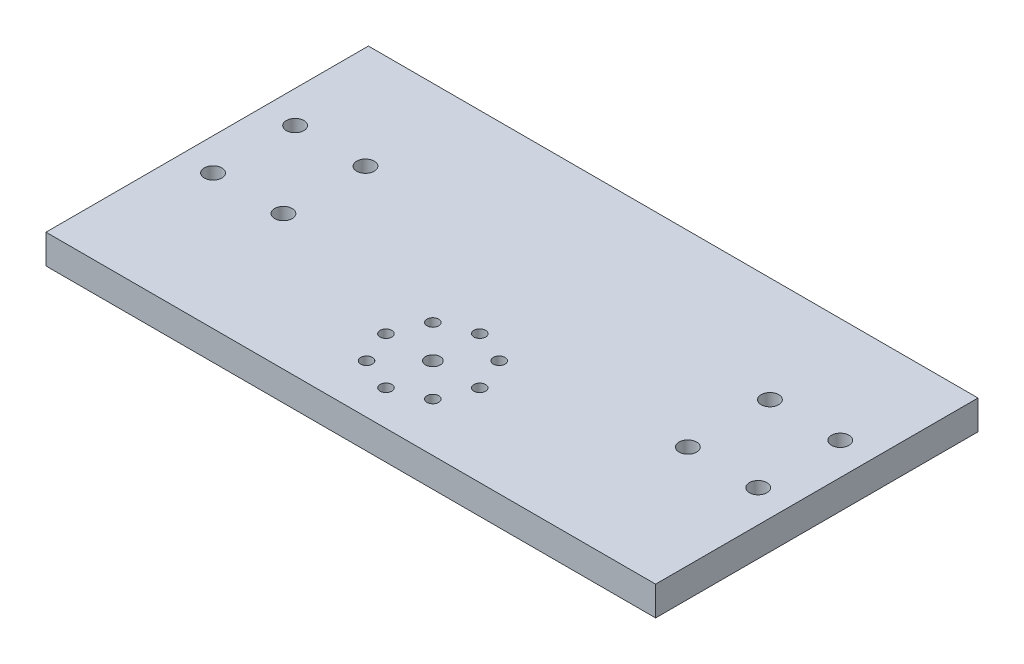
from build123d import *

# Parameters (mm, degrees)
SKETCH1_W           = 104
SKETCH1_H           = 50
SKETCH1_R           = 1.5
BOSS_EXTRUDE1_DEPTH = 5
SKETCH2_W           = 104
SKETCH2_H           = 5
BOSS_EXTRUDE2_DEPTH = 5
SKETCH4_R           = 1.25
SKETCH4_R_2         = 1
CUT_EXTRUDE1_DEPTH  = 61.241181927
SKETCH5_R           = 4
CUT_EXTRUDE2_DEPTH  = 2


with BuildPart() as part:
    # Sketch1 → Boss-Extrude1 (new body)
    with BuildSketch(Plane(origin=(0, 0, 0), x_dir=(1, 0, 0), z_dir=(0, 1, 0))):
        Rectangle(SKETCH1_W, SKETCH1_H)
        with Locations(Location((-46.5, 7, 0), (0, 0, 270))):
            Circle(SKETCH1_R, mode=Mode.SUBTRACT)
        with Locations(Location((-34.5, 7, 0), (0, 0, 270))):
            Circle(SKETCH1_R, mode=Mode.SUBTRACT)
        with Locations(Location((-34.5, -7, 0), (0, 0, 90))):
            Circle(SKETCH1_R, mode=Mode.SUBTRACT)
        with Locations(Location((-46.5, -7, 0), (0, 0, 90))):
            Circle(SKETCH1_R, mode=Mode.SUBTRACT)
        with Locations(Location((34.5, -7, 0), (0, 0, 270))):
            Circle(SKETCH1_R, mode=Mode.SUBTRACT)
        with Locations(Location((46.5, -7, 0), (0, 0, 270))):
            Circle(SKETCH1_R, mode=Mode.SUBTRACT)
        with Locations(Location((34.5, 7, 0), (0, 0, 90))):
            Circle(SKETCH1_R, mode=Mode.SUBTRACT)
        with Locations(Location((46.5, 7, 0), (0, 0, 90))):
            Circle(SKETCH1_R, mode=Mode.SUBTRACT)
    extrude(amount=BOSS_EXTRUDE1_DEPTH)

    # Sketch2 → Boss-Extrude2 (add)
    with BuildSketch(Plane.XY.offset(25)):
        with Locations((0, 2.5)):
            Rectangle(SKETCH2_W, SKETCH2_H)
    extrude(amount=BOSS_EXTRUDE2_DEPTH)

    # Sketch4 → Cut-Extrude1 (cut, through all)
    with BuildSketch(Plane.XZ):
        with Locations(Location((0, 16, 0), (0, 0, 270))):
            Circle(SKETCH4_R)
        with Locations(Location((0, 24, 0), (0, 0, 270))):
            Circle(SKETCH4_R_2)
        with Locations(Location((5.656854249, 21.656854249, 0), (0, 0, 270))):
            Circle(SKETCH4_R_2)
        with Locations(Location((8, 16, 0), (0, 0, 270))):
            Circle(SKETCH4_R_2)
        with Locations(Location((5.656854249, 10.343145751, 0), (0, 0, 270))):
            Circle(SKETCH4_R_2)
        with Locations(Location((0, 8, 0), (0, 0, 270))):
            Circle(SKETCH4_R_2)
        with Locations(Location((-5.656854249, 10.343145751, 0), (0, 0, 270))):
            Circle(SKETCH4_R_2)
        with Locations(Location((-8, 16, 0), (0, 0, 270))):
            Circle(SKETCH4_R_2)
        with Locations(Location((-5.656854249, 21.656854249, 0), (0, 0, 270))):
            Circle(SKETCH4_R_2)
    extrude(amount=-CUT_EXTRUDE1_DEPTH, mode=Mode.SUBTRACT)

    # Sketch5 → Cut-Extrude2 (cut)
    with BuildSketch(Plane.XZ):
        with Locations(Location((0, 16, 0), (0, 0, 270))):
            Circle(SKETCH5_R)
    extrude(amount=-CUT_EXTRUDE2_DEPTH, mode=Mode.SUBTRACT)


solid = part.part
